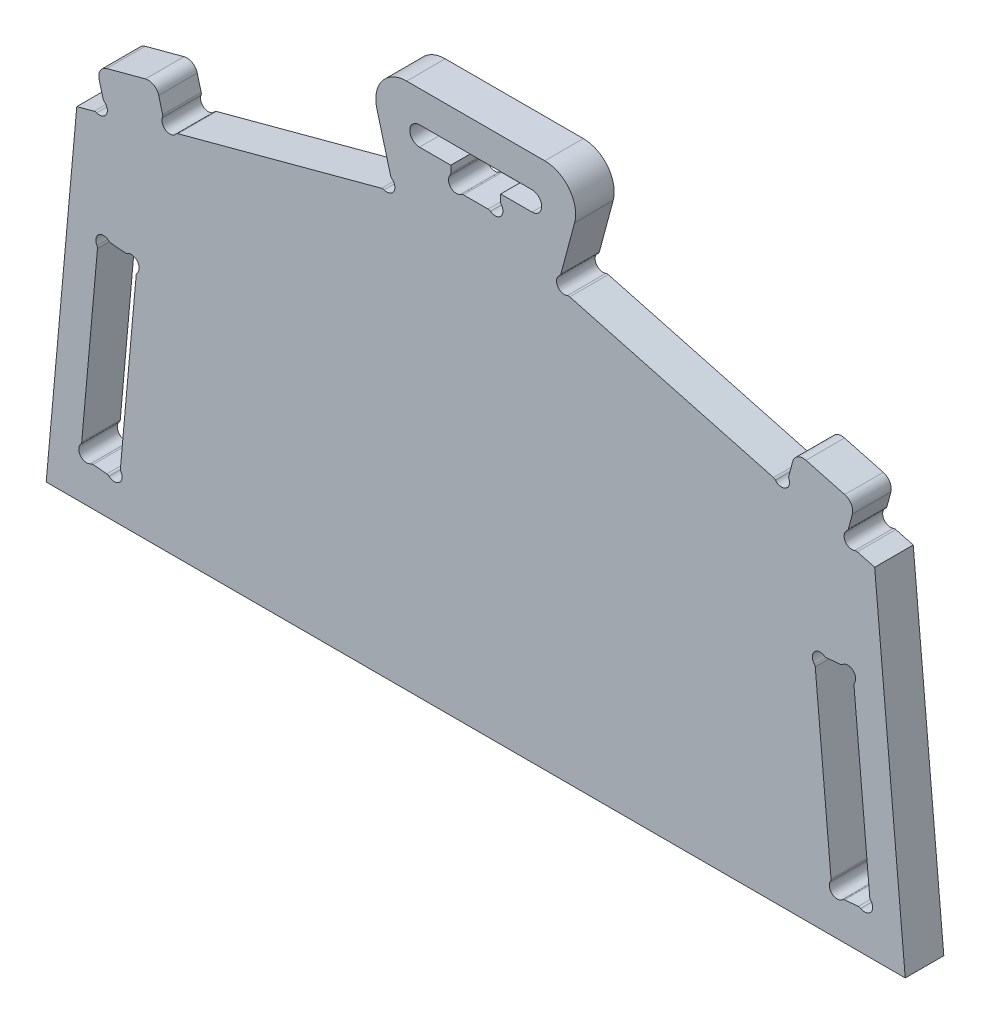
from build123d import *

# Parameters (mm, degrees)
BOSS_EXTRUDE1_DEPTH = 25
CUT_EXTRUDE1_DEPTH  = 442.759267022
FILLET1_R           = 7


with BuildPart() as part:
    # Sketch1 → Boss-Extrude1 (new body)
    with BuildSketch(Plane.XY):
        with BuildLine():
            Line((0, 0), (19.831354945, 220.72298054))
            Line((19.831354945, 220.72298054), (31.118590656, 223.747386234))
            ThreePointArc((31.118590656, 223.747386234), (31.908216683, 223.828502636), (32.683468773, 223.6579936))
            ThreePointArc((32.683468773, 223.6579936), (38.972572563, 225.851854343), (37.727959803, 232.395308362))
            ThreePointArc((37.727959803, 232.395308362), (37.192668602, 232.981441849), (36.868104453, 233.705836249))
            Line((36.868104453, 233.705836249), (32.502096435, 250))
            Line((32.502096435, 250), (71.139129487, 260.352761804))
            Line((71.139129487, 260.352761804), (75.505137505, 244.058598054))
            ThreePointArc((75.505137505, 244.058598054), (75.586253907, 243.268972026), (75.415744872, 242.493719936))
            ThreePointArc((75.415744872, 242.493719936), (77.609605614, 236.204616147), (84.153059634, 237.449228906))
            ThreePointArc((84.153059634, 237.449228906), (84.73919312, 237.984520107), (85.463587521, 238.309084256))
            Line((85.463587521, 238.309084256), (217.54227513, 273.699461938))
            ThreePointArc((217.54227513, 273.699461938), (218.331901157, 273.78057834), (219.107153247, 273.610069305))
            ThreePointArc((219.107153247, 273.610069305), (225.396257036, 275.803930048), (224.151644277, 282.347384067))
            ThreePointArc((224.151644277, 282.347384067), (223.616353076, 282.933517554), (223.291788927, 283.657911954))
            Line((223.291788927, 283.657911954), (214.405064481, 316.823619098))
            ThreePointArc((214.405064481, 316.823619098), (217.856514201, 334.17522858), (233.723581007, 342))
            Line((233.723581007, 342), (278.5, 342))
            Line((278.5, 342), (278.5, 321.625447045))
            Line((278.5, 321.625447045), (242.001681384, 321.625447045))
            ThreePointArc((242.001681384, 321.625447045), (235.726681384, 315.350447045), (242.001681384, 309.075447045))
            Line((242.001681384, 309.075447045), (262.324710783, 309.075447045))
            Line((262.324710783, 309.075447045), (262.324710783, 304.656487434))
            ThreePointArc((262.324710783, 304.656487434), (262.198692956, 303.872772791), (261.833343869, 303.168067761))
            ThreePointArc((261.833343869, 303.168067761), (262.324710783, 296.525447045), (268.967331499, 296.034080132))
            ThreePointArc((268.967331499, 296.034080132), (269.672036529, 296.399429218), (270.455751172, 296.525447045))
            Line((270.455751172, 296.525447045), (278.5, 296.525447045))
            Line((278.5, 296.525447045), (278.5, 0))
            Line((278.5, 0), (0, 0))
        make_face()
    extrude(amount=BOSS_EXTRUDE1_DEPTH)

    # Sketch2 → Cut-Extrude1 (cut, through all)
    with BuildSketch(Plane.XY):
        with BuildLine():
            Line((58.352234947, 145.475391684), (48.120501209, 31.596195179))
            ThreePointArc((48.120501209, 31.596195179), (48.175881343, 30.804347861), (48.476702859, 30.069776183))
            ThreePointArc((48.476702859, 30.069776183), (47.392880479, 23.497776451), (40.732939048, 23.602807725))
            ThreePointArc((40.732939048, 23.602807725), (40.063755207, 24.029752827), (39.294461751, 24.225397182))
            Line((39.294461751, 24.225397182), (30.392401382, 25.025222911))
            ThreePointArc((30.392401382, 25.025222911), (29.600554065, 24.969842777), (28.865982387, 24.669021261))
            ThreePointArc((28.865982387, 24.669021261), (22.293982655, 25.752843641), (22.399013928, 32.412785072))
            ThreePointArc((22.399013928, 32.412785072), (22.825959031, 33.081968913), (23.021603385, 33.851262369))
            Line((23.021603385, 33.851262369), (33.253337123, 147.730458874))
            ThreePointArc((33.253337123, 147.730458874), (33.197956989, 148.522306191), (32.897135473, 149.256877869))
            ThreePointArc((32.897135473, 149.256877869), (33.980957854, 155.828877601), (40.640899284, 155.723846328))
            ThreePointArc((40.640899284, 155.723846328), (41.310083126, 155.296901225), (42.079376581, 155.101256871))
            Line((42.079376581, 155.101256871), (50.98143695, 154.301431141))
            ThreePointArc((50.98143695, 154.301431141), (51.773284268, 154.356811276), (52.507855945, 154.657632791))
            ThreePointArc((52.507855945, 154.657632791), (59.079855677, 153.573810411), (58.974824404, 146.913868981))
            ThreePointArc((58.974824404, 146.913868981), (58.547879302, 146.244685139), (58.352234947, 145.475391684))
        make_face()
    extrude(amount=CUT_EXTRUDE1_DEPTH, mode=Mode.SUBTRACT)

    # Fillet1
    fillet1_edges = [part.edges().sort_by_distance(p)[0] for p in [
        (71.139129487, 260.352761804, 12.5),
        (32.502096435, 250, 12.5),
    ]]
    fillet(fillet1_edges, radius=FILLET1_R)

    # Sym_trie1: part across plane


with BuildPart() as part_1:
    add(part.part)
    add(part.part.mirror(Plane(origin=(278.5, 296.525447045, 25), x_dir=(0, 0, 1), z_dir=(1, 0, 0))))


solid = part_1.part
